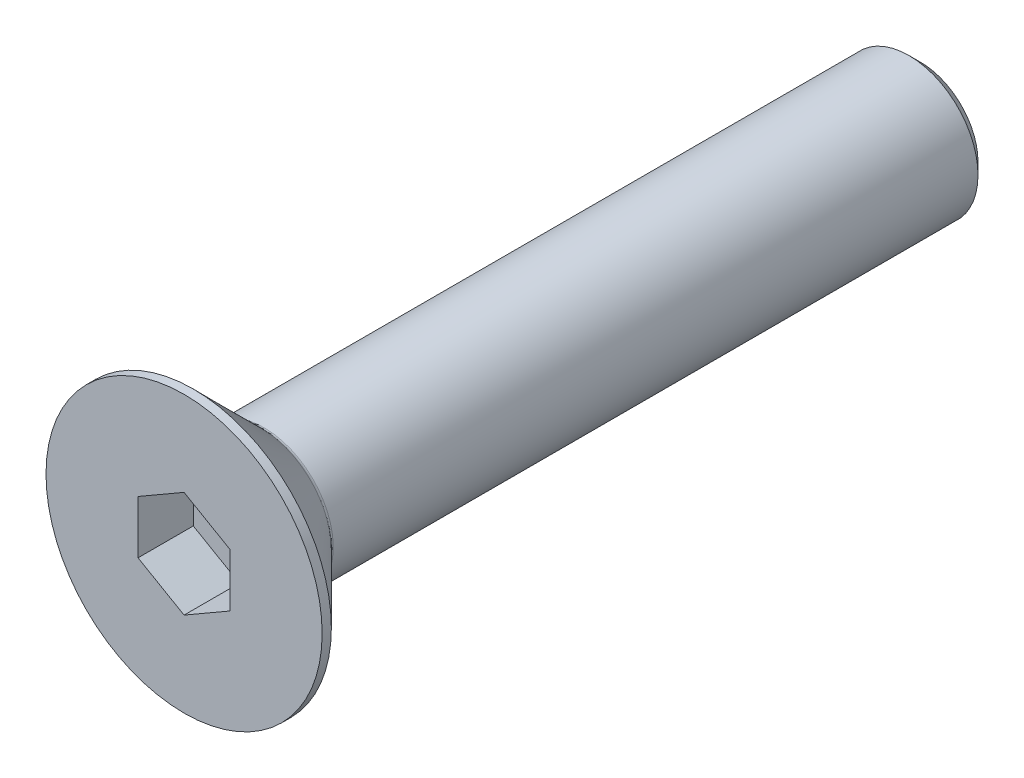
ISO-10303-21;
HEADER;
FILE_DESCRIPTION(('STEP AP214'),'2;1');
FILE_NAME('part.step','',(''),(''),'','','');
FILE_SCHEMA(('AUTOMOTIVE_DESIGN { 1 0 10303 214 1 1 1 1 }'));
ENDSEC;
DATA;
#1=APPLICATION_CONTEXT('core data for automotive mechanical design processes');
#2=APPLICATION_PROTOCOL_DEFINITION('international standard','automotive_design',2000,#1);
#3=PRODUCT_CONTEXT('',#1,'mechanical');
#4=PRODUCT('Part','Part','',(#3));
#5=PRODUCT_RELATED_PRODUCT_CATEGORY('part','',(#4));
#6=PRODUCT_DEFINITION_FORMATION('','',#4);
#7=PRODUCT_DEFINITION_CONTEXT('part definition',#1,'design');
#8=PRODUCT_DEFINITION('design','',#6,#7);
#9=PRODUCT_DEFINITION_SHAPE('','',#8);
#10=(LENGTH_UNIT() NAMED_UNIT(*) SI_UNIT(.MILLI.,.METRE.));
#11=(NAMED_UNIT(*) PLANE_ANGLE_UNIT() SI_UNIT($,.RADIAN.));
#12=(NAMED_UNIT(*) SI_UNIT($,.STERADIAN.) SOLID_ANGLE_UNIT());
#13=UNCERTAINTY_MEASURE_WITH_UNIT(LENGTH_MEASURE(1.E-05),#10,'distance_accuracy_value','');
#14=(GEOMETRIC_REPRESENTATION_CONTEXT(3) GLOBAL_UNCERTAINTY_ASSIGNED_CONTEXT((#13)) GLOBAL_UNIT_ASSIGNED_CONTEXT((#10,
#11,#12)) REPRESENTATION_CONTEXT('',''));
#15=CARTESIAN_POINT('',(0.,0.,0.));
#16=DIRECTION('',(0.,0.,1.));
#17=DIRECTION('',(1.,0.,0.));
#18=AXIS2_PLACEMENT_3D('',#15,#16,#17);
#19=CARTESIAN_POINT('',(0.,0.,-1.2));
#20=DIRECTION('',(0.,0.,1.));
#21=DIRECTION('',(1.,0.,0.));
#22=AXIS2_PLACEMENT_3D('',#19,#20,#21);
#23=PLANE('',#22);
#24=DIRECTION('',(-0.866025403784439,-0.5,0.));
#25=VECTOR('',#24,1.);
#26=CARTESIAN_POINT('',(0.,1.15470053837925,-1.2));
#27=LINE('',#26,#25);
#28=CARTESIAN_POINT('',(0.,1.15470053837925,-1.2));
#29=VERTEX_POINT('',#28);
#30=CARTESIAN_POINT('',(-1.,0.577350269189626,-1.2));
#31=VERTEX_POINT('',#30);
#32=EDGE_CURVE('E83',#29,#31,#27,.T.);
#33=ORIENTED_EDGE('',*,*,#32,.T.);
#34=DIRECTION('',(0.,1.,0.));
#35=VECTOR('',#34,1.);
#36=CARTESIAN_POINT('',(-1.,0.577350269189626,-1.2));
#37=LINE('',#36,#35);
#38=CARTESIAN_POINT('',(-1.,-0.577350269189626,-1.2));
#39=VERTEX_POINT('',#38);
#40=EDGE_CURVE('E67',#31,#39,#37,.F.);
#41=ORIENTED_EDGE('',*,*,#40,.T.);
#42=DIRECTION('',(0.866025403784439,-0.499999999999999,0.));
#43=VECTOR('',#42,1.);
#44=CARTESIAN_POINT('',(-1.,-0.577350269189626,-1.2));
#45=LINE('',#44,#43);
#46=CARTESIAN_POINT('',(0.,-1.15470053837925,-1.2));
#47=VERTEX_POINT('',#46);
#48=EDGE_CURVE('E72',#39,#47,#45,.T.);
#49=ORIENTED_EDGE('',*,*,#48,.T.);
#50=DIRECTION('',(0.866025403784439,0.5,0.));
#51=VECTOR('',#50,1.);
#52=CARTESIAN_POINT('',(0.,-1.15470053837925,-1.2));
#53=LINE('',#52,#51);
#54=CARTESIAN_POINT('',(1.,-0.577350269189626,-1.2));
#55=VERTEX_POINT('',#54);
#56=EDGE_CURVE('E129',#47,#55,#53,.T.);
#57=ORIENTED_EDGE('',*,*,#56,.T.);
#58=DIRECTION('',(0.,1.,0.));
#59=VECTOR('',#58,1.);
#60=CARTESIAN_POINT('',(1.,-0.577350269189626,-1.2));
#61=LINE('',#60,#59);
#62=CARTESIAN_POINT('',(1.,0.577350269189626,-1.2));
#63=VERTEX_POINT('',#62);
#64=EDGE_CURVE('E133',#55,#63,#61,.T.);
#65=ORIENTED_EDGE('',*,*,#64,.T.);
#66=DIRECTION('',(-0.866025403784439,0.499999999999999,0.));
#67=VECTOR('',#66,1.);
#68=CARTESIAN_POINT('',(1.,0.577350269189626,-1.2));
#69=LINE('',#68,#67);
#70=EDGE_CURVE('E138',#63,#29,#69,.T.);
#71=ORIENTED_EDGE('',*,*,#70,.T.);
#72=EDGE_LOOP('',(#33,#41,#49,#57,#65,#71));
#73=FACE_BOUND('',#72,.T.);
#74=ADVANCED_FACE('F16',(#73),#23,.T.);
#75=CARTESIAN_POINT('',(-1.,-0.577350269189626,0.));
#76=DIRECTION('',(-0.499999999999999,-0.866025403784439,0.));
#77=DIRECTION('',(0.866025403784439,-0.499999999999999,0.));
#78=AXIS2_PLACEMENT_3D('',#75,#76,#77);
#79=PLANE('',#78);
#80=DIRECTION('',(0.,0.,1.));
#81=VECTOR('',#80,1.);
#82=CARTESIAN_POINT('',(-1.,-0.577350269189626,0.));
#83=LINE('',#82,#81);
#84=CARTESIAN_POINT('',(-1.,-0.577350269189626,0.));
#85=VERTEX_POINT('',#84);
#86=EDGE_CURVE('E74',#39,#85,#83,.T.);
#87=ORIENTED_EDGE('',*,*,#86,.T.);
#88=DIRECTION('',(-0.866025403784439,0.499999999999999,0.));
#89=VECTOR('',#88,1.);
#90=CARTESIAN_POINT('',(0.,-1.15470053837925,0.));
#91=LINE('',#90,#89);
#92=CARTESIAN_POINT('',(0.,-1.15470053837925,0.));
#93=VERTEX_POINT('',#92);
#94=EDGE_CURVE('E127',#93,#85,#91,.T.);
#95=ORIENTED_EDGE('',*,*,#94,.F.);
#96=DIRECTION('',(0.,0.,1.));
#97=VECTOR('',#96,1.);
#98=CARTESIAN_POINT('',(0.,-1.15470053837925,0.));
#99=LINE('',#98,#97);
#100=EDGE_CURVE('E77',#93,#47,#99,.F.);
#101=ORIENTED_EDGE('',*,*,#100,.T.);
#102=ORIENTED_EDGE('',*,*,#48,.F.);
#103=EDGE_LOOP('',(#87,#95,#101,#102));
#104=FACE_BOUND('',#103,.T.);
#105=ADVANCED_FACE('F73',(#104),#79,.F.);
#106=CARTESIAN_POINT('',(-1.,0.577350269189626,0.));
#107=DIRECTION('',(-1.,0.,0.));
#108=DIRECTION('',(0.,0.,1.));
#109=AXIS2_PLACEMENT_3D('',#106,#107,#108);
#110=PLANE('',#109);
#111=DIRECTION('',(0.,0.,1.));
#112=VECTOR('',#111,1.);
#113=CARTESIAN_POINT('',(-1.,0.577350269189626,0.));
#114=LINE('',#113,#112);
#115=CARTESIAN_POINT('',(-1.,0.577350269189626,0.));
#116=VERTEX_POINT('',#115);
#117=EDGE_CURVE('E85',#31,#116,#114,.T.);
#118=ORIENTED_EDGE('',*,*,#117,.T.);
#119=DIRECTION('',(0.,1.,0.));
#120=VECTOR('',#119,1.);
#121=CARTESIAN_POINT('',(-1.,0.,0.));
#122=LINE('',#121,#120);
#123=EDGE_CURVE('E89',#85,#116,#122,.T.);
#124=ORIENTED_EDGE('',*,*,#123,.F.);
#125=ORIENTED_EDGE('',*,*,#86,.F.);
#126=ORIENTED_EDGE('',*,*,#40,.F.);
#127=EDGE_LOOP('',(#118,#124,#125,#126));
#128=FACE_BOUND('',#127,.T.);
#129=ADVANCED_FACE('F87',(#128),#110,.F.);
#130=CARTESIAN_POINT('',(0.,1.15470053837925,0.));
#131=DIRECTION('',(-0.5,0.866025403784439,0.));
#132=DIRECTION('',(-0.866025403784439,-0.5,0.));
#133=AXIS2_PLACEMENT_3D('',#130,#131,#132);
#134=PLANE('',#133);
#135=DIRECTION('',(0.,0.,1.));
#136=VECTOR('',#135,1.);
#137=CARTESIAN_POINT('',(0.,1.15470053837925,0.));
#138=LINE('',#137,#136);
#139=CARTESIAN_POINT('',(0.,1.15470053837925,0.));
#140=VERTEX_POINT('',#139);
#141=EDGE_CURVE('E140',#29,#140,#138,.T.);
#142=ORIENTED_EDGE('',*,*,#141,.T.);
#143=DIRECTION('',(0.866025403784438,0.5,0.));
#144=VECTOR('',#143,1.);
#145=CARTESIAN_POINT('',(-1.,0.577350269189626,0.));
#146=LINE('',#145,#144);
#147=EDGE_CURVE('E123',#116,#140,#146,.T.);
#148=ORIENTED_EDGE('',*,*,#147,.F.);
#149=ORIENTED_EDGE('',*,*,#117,.F.);
#150=ORIENTED_EDGE('',*,*,#32,.F.);
#151=EDGE_LOOP('',(#142,#148,#149,#150));
#152=FACE_BOUND('',#151,.T.);
#153=ADVANCED_FACE('F144',(#152),#134,.F.);
#154=CARTESIAN_POINT('',(1.,0.577350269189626,0.));
#155=DIRECTION('',(0.499999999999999,0.866025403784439,0.));
#156=DIRECTION('',(-0.866025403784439,0.499999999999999,0.));
#157=AXIS2_PLACEMENT_3D('',#154,#155,#156);
#158=PLANE('',#157);
#159=DIRECTION('',(0.,0.,-1.));
#160=VECTOR('',#159,1.);
#161=CARTESIAN_POINT('',(1.,0.577350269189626,0.));
#162=LINE('',#161,#160);
#163=CARTESIAN_POINT('',(1.,0.577350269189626,0.));
#164=VERTEX_POINT('',#163);
#165=EDGE_CURVE('E136',#63,#164,#162,.F.);
#166=ORIENTED_EDGE('',*,*,#165,.T.);
#167=DIRECTION('',(0.866025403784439,-0.5,0.));
#168=VECTOR('',#167,1.);
#169=CARTESIAN_POINT('',(0.,1.15470053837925,0.));
#170=LINE('',#169,#168);
#171=EDGE_CURVE('E120',#140,#164,#170,.T.);
#172=ORIENTED_EDGE('',*,*,#171,.F.);
#173=ORIENTED_EDGE('',*,*,#141,.F.);
#174=ORIENTED_EDGE('',*,*,#70,.F.);
#175=EDGE_LOOP('',(#166,#172,#173,#174));
#176=FACE_BOUND('',#175,.T.);
#177=ADVANCED_FACE('F155',(#176),#158,.F.);
#178=CARTESIAN_POINT('',(1.,-0.577350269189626,0.));
#179=DIRECTION('',(1.,0.,0.));
#180=DIRECTION('',(0.,0.,-1.));
#181=AXIS2_PLACEMENT_3D('',#178,#179,#180);
#182=PLANE('',#181);
#183=DIRECTION('',(0.,0.,1.));
#184=VECTOR('',#183,1.);
#185=CARTESIAN_POINT('',(1.,-0.577350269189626,0.));
#186=LINE('',#185,#184);
#187=CARTESIAN_POINT('',(1.,-0.577350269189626,0.));
#188=VERTEX_POINT('',#187);
#189=EDGE_CURVE('E35',#55,#188,#186,.T.);
#190=ORIENTED_EDGE('',*,*,#189,.T.);
#191=DIRECTION('',(0.,1.,0.));
#192=VECTOR('',#191,1.);
#193=CARTESIAN_POINT('',(1.,0.,0.));
#194=LINE('',#193,#192);
#195=EDGE_CURVE('E117',#164,#188,#194,.F.);
#196=ORIENTED_EDGE('',*,*,#195,.F.);
#197=ORIENTED_EDGE('',*,*,#165,.F.);
#198=ORIENTED_EDGE('',*,*,#64,.F.);
#199=EDGE_LOOP('',(#190,#196,#197,#198));
#200=FACE_BOUND('',#199,.T.);
#201=ADVANCED_FACE('F153',(#200),#182,.F.);
#202=CARTESIAN_POINT('',(0.,-1.15470053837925,0.));
#203=DIRECTION('',(0.5,-0.866025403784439,0.));
#204=DIRECTION('',(0.866025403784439,0.5,0.));
#205=AXIS2_PLACEMENT_3D('',#202,#203,#204);
#206=PLANE('',#205);
#207=ORIENTED_EDGE('',*,*,#100,.F.);
#208=DIRECTION('',(-0.866025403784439,-0.5,0.));
#209=VECTOR('',#208,1.);
#210=CARTESIAN_POINT('',(1.,-0.577350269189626,0.));
#211=LINE('',#210,#209);
#212=EDGE_CURVE('E114',#188,#93,#211,.T.);
#213=ORIENTED_EDGE('',*,*,#212,.F.);
#214=ORIENTED_EDGE('',*,*,#189,.F.);
#215=ORIENTED_EDGE('',*,*,#56,.F.);
#216=EDGE_LOOP('',(#207,#213,#214,#215));
#217=FACE_BOUND('',#216,.T.);
#218=ADVANCED_FACE('F151',(#217),#206,.F.);
#219=CARTESIAN_POINT('',(1.5,0.,0.));
#220=DIRECTION('',(0.,0.,1.));
#221=DIRECTION('',(1.,0.,0.));
#222=AXIS2_PLACEMENT_3D('',#219,#220,#221);
#223=PLANE('',#222);
#224=ORIENTED_EDGE('',*,*,#195,.T.);
#225=ORIENTED_EDGE('',*,*,#212,.T.);
#226=ORIENTED_EDGE('',*,*,#94,.T.);
#227=ORIENTED_EDGE('',*,*,#123,.T.);
#228=ORIENTED_EDGE('',*,*,#147,.T.);
#229=ORIENTED_EDGE('',*,*,#171,.T.);
#230=EDGE_LOOP('',(#224,#225,#226,#227,#228,#229));
#231=FACE_BOUND('',#230,.T.);
#232=CARTESIAN_POINT('',(0.,0.,0.));
#233=DIRECTION('',(0.,0.,-1.));
#234=DIRECTION('',(-1.,0.,0.));
#235=AXIS2_PLACEMENT_3D('',#232,#233,#234);
#236=CIRCLE('',#235,3.);
#237=CARTESIAN_POINT('',(-3.,0.,0.));
#238=VERTEX_POINT('',#237);
#239=EDGE_CURVE('E20',#238,#238,#236,.T.);
#240=ORIENTED_EDGE('',*,*,#239,.F.);
#241=EDGE_LOOP('',(#240));
#242=FACE_BOUND('',#241,.T.);
#243=ADVANCED_FACE('F148',(#231,#242),#223,.T.);
#244=CARTESIAN_POINT('',(0.,0.,-0.1));
#245=DIRECTION('',(0.,0.,-1.));
#246=DIRECTION('',(-1.,0.,0.));
#247=AXIS2_PLACEMENT_3D('',#244,#245,#246);
#248=CYLINDRICAL_SURFACE('',#247,3.);
#249=ORIENTED_EDGE('',*,*,#239,.T.);
#250=EDGE_LOOP('',(#249));
#251=FACE_BOUND('',#250,.T.);
#252=CARTESIAN_POINT('',(0.,0.,-0.199999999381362));
#253=DIRECTION('',(0.,0.,1.));
#254=DIRECTION('',(1.,0.,0.));
#255=AXIS2_PLACEMENT_3D('',#252,#253,#254);
#256=CIRCLE('',#255,2.99999999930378);
#257=CARTESIAN_POINT('',(2.99999999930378,0.,-0.199999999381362));
#258=VERTEX_POINT('',#257);
#259=EDGE_CURVE('E101',#258,#258,#256,.F.);
#260=ORIENTED_EDGE('',*,*,#259,.F.);
#261=EDGE_LOOP('',(#260));
#262=FACE_BOUND('',#261,.T.);
#263=ADVANCED_FACE('F184',(#251,#262),#248,.T.);
#264=CARTESIAN_POINT('',(0.,0.,-0.199999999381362));
#265=DIRECTION('',(0.,0.,1.));
#266=DIRECTION('',(1.,0.,0.));
#267=AXIS2_PLACEMENT_3D('',#264,#265,#266);
#268=CONICAL_SURFACE('',#267,2.99999999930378,0.785398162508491);
#269=CARTESIAN_POINT('',(0.,0.,-1.67071067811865));
#270=DIRECTION('',(0.,0.,-1.));
#271=DIRECTION('',(0.,1.,0.));
#272=AXIS2_PLACEMENT_3D('',#269,#270,#271);
#273=CIRCLE('',#272,1.52928932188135);
#274=CARTESIAN_POINT('',(0.,1.52928932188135,-1.67071067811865));
#275=VERTEX_POINT('',#274);
#276=EDGE_CURVE('E95',#275,#275,#273,.T.);
#277=ORIENTED_EDGE('',*,*,#276,.F.);
#278=EDGE_LOOP('',(#277));
#279=FACE_BOUND('',#278,.T.);
#280=ORIENTED_EDGE('',*,*,#259,.T.);
#281=EDGE_LOOP('',(#280));
#282=FACE_BOUND('',#281,.T.);
#283=ADVANCED_FACE('F180',(#279,#282),#268,.T.);
#284=CARTESIAN_POINT('',(0.75,0.,-16.));
#285=DIRECTION('',(0.,0.,-1.));
#286=DIRECTION('',(-1.,0.,0.));
#287=AXIS2_PLACEMENT_3D('',#284,#285,#286);
#288=PLANE('',#287);
#289=CARTESIAN_POINT('',(0.,0.,-16.0000000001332));
#290=DIRECTION('',(0.,0.,1.));
#291=DIRECTION('',(1.,0.,0.));
#292=AXIS2_PLACEMENT_3D('',#289,#290,#291);
#293=CIRCLE('',#292,1.25000000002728);
#294=CARTESIAN_POINT('',(1.25000000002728,0.,-16.0000000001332));
#295=VERTEX_POINT('',#294);
#296=EDGE_CURVE('E93',#295,#295,#293,.T.);
#297=ORIENTED_EDGE('',*,*,#296,.F.);
#298=EDGE_LOOP('',(#297));
#299=FACE_BOUND('',#298,.T.);
#300=ADVANCED_FACE('F177',(#299),#288,.T.);
#301=CARTESIAN_POINT('',(0.,0.,-1.74142135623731));
#302=DIRECTION('',(0.,0.,-1.));
#303=DIRECTION('',(-1.,0.,0.));
#304=AXIS2_PLACEMENT_3D('',#301,#302,#303);
#305=TOROIDAL_SURFACE('',#304,1.6,0.0999999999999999);
#306=CARTESIAN_POINT('',(0.,0.,-1.74142135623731));
#307=DIRECTION('',(0.,0.,-1.));
#308=DIRECTION('',(-1.,0.,0.));
#309=AXIS2_PLACEMENT_3D('',#306,#307,#308);
#310=CIRCLE('',#309,1.5);
#311=CARTESIAN_POINT('',(-1.5,0.,-1.74142135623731));
#312=VERTEX_POINT('',#311);
#313=EDGE_CURVE('E26',#312,#312,#310,.T.);
#314=ORIENTED_EDGE('',*,*,#313,.F.);
#315=EDGE_LOOP('',(#314));
#316=FACE_BOUND('',#315,.T.);
#317=ORIENTED_EDGE('',*,*,#276,.T.);
#318=EDGE_LOOP('',(#317));
#319=FACE_BOUND('',#318,.T.);
#320=ADVANCED_FACE('F18',(#316,#319),#305,.F.);
#321=CARTESIAN_POINT('',(0.,0.,-15.7499999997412));
#322=DIRECTION('',(0.,0.,1.));
#323=DIRECTION('',(1.,0.,0.));
#324=AXIS2_PLACEMENT_3D('',#321,#322,#323);
#325=CONICAL_SURFACE('',#324,1.49999999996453,0.785398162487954);
#326=ORIENTED_EDGE('',*,*,#296,.T.);
#327=EDGE_LOOP('',(#326));
#328=FACE_BOUND('',#327,.T.);
#329=CARTESIAN_POINT('',(0.,0.,-15.75));
#330=DIRECTION('',(0.,0.,-1.));
#331=DIRECTION('',(-1.,0.,0.));
#332=AXIS2_PLACEMENT_3D('',#329,#330,#331);
#333=CIRCLE('',#332,1.5);
#334=CARTESIAN_POINT('',(-1.5,0.,-15.75));
#335=VERTEX_POINT('',#334);
#336=EDGE_CURVE('E11',#335,#335,#333,.F.);
#337=ORIENTED_EDGE('',*,*,#336,.F.);
#338=EDGE_LOOP('',(#337));
#339=FACE_BOUND('',#338,.T.);
#340=ADVANCED_FACE('F167',(#328,#339),#325,.T.);
#341=CARTESIAN_POINT('',(0.,0.,-8.85));
#342=DIRECTION('',(0.,0.,-1.));
#343=DIRECTION('',(-1.,0.,0.));
#344=AXIS2_PLACEMENT_3D('',#341,#342,#343);
#345=CYLINDRICAL_SURFACE('',#344,1.5);
#346=ORIENTED_EDGE('',*,*,#336,.T.);
#347=EDGE_LOOP('',(#346));
#348=FACE_BOUND('',#347,.T.);
#349=ORIENTED_EDGE('',*,*,#313,.T.);
#350=EDGE_LOOP('',(#349));
#351=FACE_BOUND('',#350,.T.);
#352=ADVANCED_FACE('F165',(#348,#351),#345,.T.);
#353=CLOSED_SHELL('',(#74,#105,#129,#153,#177,#201,#218,#243,#263,#283,#300,#320,#340,#352));
#354=MANIFOLD_SOLID_BREP('B1',#353);
#355=ADVANCED_BREP_SHAPE_REPRESENTATION('',(#18,#354),#14);
#356=SHAPE_DEFINITION_REPRESENTATION(#9,#355);
ENDSEC;
END-ISO-10303-21;
